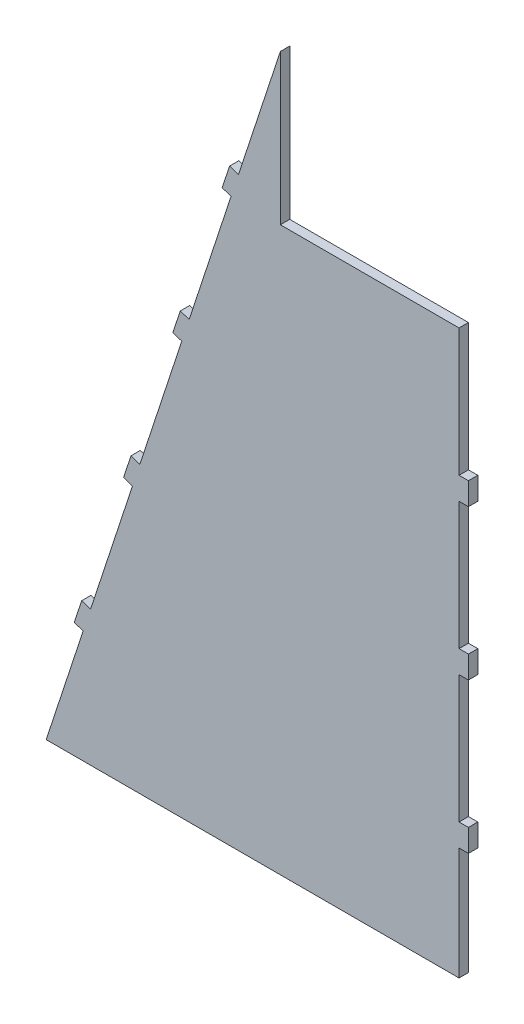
ISO-10303-21;
HEADER;
FILE_DESCRIPTION(('STEP AP214'),'2;1');
FILE_NAME('part.step','',(''),(''),'','','');
FILE_SCHEMA(('AUTOMOTIVE_DESIGN { 1 0 10303 214 1 1 1 1 }'));
ENDSEC;
DATA;
#1=APPLICATION_CONTEXT('core data for automotive mechanical design processes');
#2=APPLICATION_PROTOCOL_DEFINITION('international standard','automotive_design',2000,#1);
#3=PRODUCT_CONTEXT('',#1,'mechanical');
#4=PRODUCT('Part','Part','',(#3));
#5=PRODUCT_RELATED_PRODUCT_CATEGORY('part','',(#4));
#6=PRODUCT_DEFINITION_FORMATION('','',#4);
#7=PRODUCT_DEFINITION_CONTEXT('part definition',#1,'design');
#8=PRODUCT_DEFINITION('design','',#6,#7);
#9=PRODUCT_DEFINITION_SHAPE('','',#8);
#10=(LENGTH_UNIT() NAMED_UNIT(*) SI_UNIT(.MILLI.,.METRE.));
#11=(NAMED_UNIT(*) PLANE_ANGLE_UNIT() SI_UNIT($,.RADIAN.));
#12=(NAMED_UNIT(*) SI_UNIT($,.STERADIAN.) SOLID_ANGLE_UNIT());
#13=UNCERTAINTY_MEASURE_WITH_UNIT(LENGTH_MEASURE(1.E-05),#10,'distance_accuracy_value','');
#14=(GEOMETRIC_REPRESENTATION_CONTEXT(3) GLOBAL_UNCERTAINTY_ASSIGNED_CONTEXT((#13)) GLOBAL_UNIT_ASSIGNED_CONTEXT((#10,
#11,#12)) REPRESENTATION_CONTEXT('',''));
#15=CARTESIAN_POINT('',(0.,0.,0.));
#16=DIRECTION('',(0.,0.,1.));
#17=DIRECTION('',(1.,0.,0.));
#18=AXIS2_PLACEMENT_3D('',#15,#16,#17);
#19=CARTESIAN_POINT('',(26.5042552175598,80.7078217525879,2.5));
#20=DIRECTION('',(-0.312004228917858,-0.950080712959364,0.));
#21=DIRECTION('',(0.950080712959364,-0.312004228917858,0.));
#22=AXIS2_PLACEMENT_3D('',#19,#20,#21);
#23=PLANE('',#22);
#24=DIRECTION('',(-0.950080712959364,0.312004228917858,0.));
#25=VECTOR('',#24,1.);
#26=CARTESIAN_POINT('',(26.5042552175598,80.7078217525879,0.));
#27=LINE('',#26,#25);
#28=CARTESIAN_POINT('',(-26.4218896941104,98.0886408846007,0.));
#29=VERTEX_POINT('',#28);
#30=CARTESIAN_POINT('',(-28.7970914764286,98.868651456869,0.));
#31=VERTEX_POINT('',#30);
#32=EDGE_CURVE('E283',#29,#31,#27,.T.);
#33=ORIENTED_EDGE('',*,*,#32,.F.);
#34=DIRECTION('',(0.,0.,-1.));
#35=VECTOR('',#34,1.);
#36=CARTESIAN_POINT('',(-26.4218896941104,98.0886408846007,2.5));
#37=LINE('',#36,#35);
#38=CARTESIAN_POINT('',(-26.4218896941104,98.0886408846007,2.5));
#39=VERTEX_POINT('',#38);
#40=EDGE_CURVE('E11',#39,#29,#37,.T.);
#41=ORIENTED_EDGE('',*,*,#40,.F.);
#42=DIRECTION('',(-0.950080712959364,0.312004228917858,0.));
#43=VECTOR('',#42,1.);
#44=CARTESIAN_POINT('',(26.5042552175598,80.7078217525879,2.5));
#45=LINE('',#44,#43);
#46=CARTESIAN_POINT('',(-28.7970914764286,98.868651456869,2.5));
#47=VERTEX_POINT('',#46);
#48=EDGE_CURVE('E376',#39,#47,#45,.T.);
#49=ORIENTED_EDGE('',*,*,#48,.T.);
#50=DIRECTION('',(0.,0.,-1.));
#51=VECTOR('',#50,1.);
#52=CARTESIAN_POINT('',(-28.7970914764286,98.868651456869,2.5));
#53=LINE('',#52,#51);
#54=EDGE_CURVE('E55',#47,#31,#53,.T.);
#55=ORIENTED_EDGE('',*,*,#54,.T.);
#56=EDGE_LOOP('',(#33,#41,#49,#55));
#57=FACE_BOUND('',#56,.T.);
#58=ADVANCED_FACE('F39',(#57),#23,.T.);
#59=CARTESIAN_POINT('',(-52.9261449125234,17.3808191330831,2.5));
#60=DIRECTION('',(0.95008071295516,-0.31200422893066,0.));
#61=DIRECTION('',(0.31200422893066,0.95008071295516,0.));
#62=AXIS2_PLACEMENT_3D('',#59,#60,#61);
#63=PLANE('',#62);
#64=DIRECTION('',(-0.31200422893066,-0.95008071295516,0.));
#65=VECTOR('',#64,1.);
#66=CARTESIAN_POINT('',(-52.9261449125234,17.3808191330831,0.));
#67=LINE('',#66,#65);
#68=CARTESIAN_POINT('',(-37.5868821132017,64.0902428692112,0.));
#69=VERTEX_POINT('',#68);
#70=EDGE_CURVE('E285',#29,#69,#67,.T.);
#71=ORIENTED_EDGE('',*,*,#70,.T.);
#72=DIRECTION('',(0.,0.,-1.));
#73=VECTOR('',#72,1.);
#74=CARTESIAN_POINT('',(-37.5868821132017,64.0902428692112,2.5));
#75=LINE('',#74,#73);
#76=CARTESIAN_POINT('',(-37.5868821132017,64.0902428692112,2.5));
#77=VERTEX_POINT('',#76);
#78=EDGE_CURVE('E47',#77,#69,#75,.T.);
#79=ORIENTED_EDGE('',*,*,#78,.F.);
#80=DIRECTION('',(-0.31200422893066,-0.95008071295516,0.));
#81=VECTOR('',#80,1.);
#82=CARTESIAN_POINT('',(-52.9261449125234,17.3808191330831,2.5));
#83=LINE('',#82,#81);
#84=EDGE_CURVE('E456',#39,#77,#83,.T.);
#85=ORIENTED_EDGE('',*,*,#84,.F.);
#86=ORIENTED_EDGE('',*,*,#40,.T.);
#87=EDGE_LOOP('',(#71,#79,#85,#86));
#88=FACE_BOUND('',#87,.T.);
#89=ADVANCED_FACE('F443',(#88),#63,.F.);
#90=CARTESIAN_POINT('',(15.3392627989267,46.7094237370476,2.5));
#91=DIRECTION('',(0.312004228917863,0.950080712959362,0.));
#92=DIRECTION('',(-0.950080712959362,0.312004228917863,0.));
#93=AXIS2_PLACEMENT_3D('',#90,#91,#92);
#94=PLANE('',#93);
#95=DIRECTION('',(0.950080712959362,-0.312004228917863,0.));
#96=VECTOR('',#95,1.);
#97=CARTESIAN_POINT('',(15.3392627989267,46.7094237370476,0.));
#98=LINE('',#97,#96);
#99=CARTESIAN_POINT('',(-39.9620838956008,64.8702534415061,0.));
#100=VERTEX_POINT('',#99);
#101=EDGE_CURVE('E288',#100,#69,#98,.T.);
#102=ORIENTED_EDGE('',*,*,#101,.F.);
#103=DIRECTION('',(0.,0.,-1.));
#104=VECTOR('',#103,1.);
#105=CARTESIAN_POINT('',(-39.9620838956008,64.8702534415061,2.5));
#106=LINE('',#105,#104);
#107=CARTESIAN_POINT('',(-39.9620838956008,64.8702534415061,2.5));
#108=VERTEX_POINT('',#107);
#109=EDGE_CURVE('E433',#108,#100,#106,.T.);
#110=ORIENTED_EDGE('',*,*,#109,.F.);
#111=DIRECTION('',(0.950080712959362,-0.312004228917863,0.));
#112=VECTOR('',#111,1.);
#113=CARTESIAN_POINT('',(15.3392627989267,46.7094237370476,2.5));
#114=LINE('',#113,#112);
#115=EDGE_CURVE('E440',#108,#77,#114,.T.);
#116=ORIENTED_EDGE('',*,*,#115,.T.);
#117=ORIENTED_EDGE('',*,*,#78,.T.);
#118=EDGE_LOOP('',(#102,#110,#116,#117));
#119=FACE_BOUND('',#118,.T.);
#120=ADVANCED_FACE('F438',(#119),#94,.T.);
#121=CARTESIAN_POINT('',(-55.3013466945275,18.1608297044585,2.5));
#122=DIRECTION('',(-0.950080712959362,0.312004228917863,0.));
#123=DIRECTION('',(-0.312004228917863,-0.950080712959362,0.));
#124=AXIS2_PLACEMENT_3D('',#121,#122,#123);
#125=PLANE('',#124);
#126=DIRECTION('',(0.312004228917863,0.950080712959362,0.));
#127=VECTOR('',#126,1.);
#128=CARTESIAN_POINT('',(-55.3013466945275,18.1608297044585,0.));
#129=LINE('',#128,#127);
#130=CARTESIAN_POINT('',(-41.9324695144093,58.8702534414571,0.));
#131=VERTEX_POINT('',#130);
#132=EDGE_CURVE('E291',#131,#100,#129,.T.);
#133=ORIENTED_EDGE('',*,*,#132,.F.);
#134=DIRECTION('',(0.,0.,-1.));
#135=VECTOR('',#134,1.);
#136=CARTESIAN_POINT('',(-41.9324695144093,58.8702534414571,2.5));
#137=LINE('',#136,#135);
#138=CARTESIAN_POINT('',(-41.9324695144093,58.8702534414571,2.5));
#139=VERTEX_POINT('',#138);
#140=EDGE_CURVE('E431',#139,#131,#137,.T.);
#141=ORIENTED_EDGE('',*,*,#140,.F.);
#142=DIRECTION('',(0.312004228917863,0.950080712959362,0.));
#143=VECTOR('',#142,1.);
#144=CARTESIAN_POINT('',(-55.3013466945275,18.1608297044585,2.5));
#145=LINE('',#144,#143);
#146=EDGE_CURVE('E453',#139,#108,#145,.T.);
#147=ORIENTED_EDGE('',*,*,#146,.T.);
#148=ORIENTED_EDGE('',*,*,#109,.T.);
#149=EDGE_LOOP('',(#133,#141,#147,#148));
#150=FACE_BOUND('',#149,.T.);
#151=ADVANCED_FACE('F450',(#150),#125,.T.);
#152=CARTESIAN_POINT('',(13.3688771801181,40.709423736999,2.5));
#153=DIRECTION('',(-0.312004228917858,-0.950080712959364,0.));
#154=DIRECTION('',(0.950080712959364,-0.312004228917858,0.));
#155=AXIS2_PLACEMENT_3D('',#152,#153,#154);
#156=PLANE('',#155);
#157=DIRECTION('',(-0.950080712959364,0.312004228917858,0.));
#158=VECTOR('',#157,1.);
#159=CARTESIAN_POINT('',(13.3688771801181,40.709423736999,0.));
#160=LINE('',#159,#158);
#161=CARTESIAN_POINT('',(-39.5572677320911,58.0902428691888,0.));
#162=VERTEX_POINT('',#161);
#163=EDGE_CURVE('E294',#162,#131,#160,.T.);
#164=ORIENTED_EDGE('',*,*,#163,.F.);
#165=DIRECTION('',(0.,0.,-1.));
#166=VECTOR('',#165,1.);
#167=CARTESIAN_POINT('',(-39.5572677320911,58.0902428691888,2.5));
#168=LINE('',#167,#166);
#169=CARTESIAN_POINT('',(-39.5572677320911,58.0902428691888,2.5));
#170=VERTEX_POINT('',#169);
#171=EDGE_CURVE('E429',#170,#162,#168,.T.);
#172=ORIENTED_EDGE('',*,*,#171,.F.);
#173=DIRECTION('',(-0.950080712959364,0.312004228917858,0.));
#174=VECTOR('',#173,1.);
#175=CARTESIAN_POINT('',(13.3688771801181,40.709423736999,2.5));
#176=LINE('',#175,#174);
#177=EDGE_CURVE('E458',#170,#139,#176,.T.);
#178=ORIENTED_EDGE('',*,*,#177,.T.);
#179=ORIENTED_EDGE('',*,*,#140,.T.);
#180=EDGE_LOOP('',(#164,#172,#178,#179));
#181=FACE_BOUND('',#180,.T.);
#182=ADVANCED_FACE('F559',(#181),#156,.T.);
#183=CARTESIAN_POINT('',(-52.9261449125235,17.3808191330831,2.5));
#184=DIRECTION('',(0.95008071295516,-0.31200422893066,0.));
#185=DIRECTION('',(0.31200422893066,0.95008071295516,0.));
#186=AXIS2_PLACEMENT_3D('',#183,#184,#185);
#187=PLANE('',#186);
#188=DIRECTION('',(-0.31200422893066,-0.95008071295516,0.));
#189=VECTOR('',#188,1.);
#190=CARTESIAN_POINT('',(-52.9261449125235,17.3808191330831,0.));
#191=LINE('',#190,#189);
#192=CARTESIAN_POINT('',(-50.7227862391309,24.0902428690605,0.));
#193=VERTEX_POINT('',#192);
#194=EDGE_CURVE('E297',#162,#193,#191,.T.);
#195=ORIENTED_EDGE('',*,*,#194,.T.);
#196=DIRECTION('',(0.,0.,-1.));
#197=VECTOR('',#196,1.);
#198=CARTESIAN_POINT('',(-50.7227862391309,24.0902428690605,2.5));
#199=LINE('',#198,#197);
#200=CARTESIAN_POINT('',(-50.7227862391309,24.0902428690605,2.5));
#201=VERTEX_POINT('',#200);
#202=EDGE_CURVE('E427',#201,#193,#199,.T.);
#203=ORIENTED_EDGE('',*,*,#202,.F.);
#204=DIRECTION('',(-0.31200422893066,-0.95008071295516,0.));
#205=VECTOR('',#204,1.);
#206=CARTESIAN_POINT('',(-52.9261449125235,17.3808191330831,2.5));
#207=LINE('',#206,#205);
#208=EDGE_CURVE('E464',#170,#201,#207,.T.);
#209=ORIENTED_EDGE('',*,*,#208,.F.);
#210=ORIENTED_EDGE('',*,*,#171,.T.);
#211=EDGE_LOOP('',(#195,#203,#209,#210));
#212=FACE_BOUND('',#211,.T.);
#213=ADVANCED_FACE('F562',(#212),#187,.F.);
#214=CARTESIAN_POINT('',(2.20335867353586,6.70942373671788,2.5));
#215=DIRECTION('',(0.3120042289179,0.95008071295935,0.));
#216=DIRECTION('',(-0.95008071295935,0.3120042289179,0.));
#217=AXIS2_PLACEMENT_3D('',#214,#215,#216);
#218=PLANE('',#217);
#219=DIRECTION('',(0.95008071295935,-0.3120042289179,0.));
#220=VECTOR('',#219,1.);
#221=CARTESIAN_POINT('',(2.20335867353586,6.70942373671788,0.));
#222=LINE('',#221,#220);
#223=CARTESIAN_POINT('',(-53.0979880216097,24.8702534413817,0.));
#224=VERTEX_POINT('',#223);
#225=EDGE_CURVE('E300',#224,#193,#222,.T.);
#226=ORIENTED_EDGE('',*,*,#225,.F.);
#227=DIRECTION('',(0.,0.,-1.));
#228=VECTOR('',#227,1.);
#229=CARTESIAN_POINT('',(-53.0979880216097,24.8702534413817,2.5));
#230=LINE('',#229,#228);
#231=CARTESIAN_POINT('',(-53.0979880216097,24.8702534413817,2.5));
#232=VERTEX_POINT('',#231);
#233=EDGE_CURVE('E425',#232,#224,#230,.T.);
#234=ORIENTED_EDGE('',*,*,#233,.F.);
#235=DIRECTION('',(0.95008071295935,-0.3120042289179,0.));
#236=VECTOR('',#235,1.);
#237=CARTESIAN_POINT('',(2.20335867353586,6.70942373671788,2.5));
#238=LINE('',#237,#236);
#239=EDGE_CURVE('E466',#232,#201,#238,.T.);
#240=ORIENTED_EDGE('',*,*,#239,.T.);
#241=ORIENTED_EDGE('',*,*,#202,.T.);
#242=EDGE_LOOP('',(#226,#234,#240,#241));
#243=FACE_BOUND('',#242,.T.);
#244=ADVANCED_FACE('F566',(#243),#218,.T.);
#245=CARTESIAN_POINT('',(-55.3013466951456,18.1608297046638,2.5));
#246=DIRECTION('',(-0.95008071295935,0.312004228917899,0.));
#247=DIRECTION('',(-0.312004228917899,-0.95008071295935,0.));
#248=AXIS2_PLACEMENT_3D('',#245,#246,#247);
#249=PLANE('',#248);
#250=DIRECTION('',(0.312004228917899,0.95008071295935,0.));
#251=VECTOR('',#250,1.);
#252=CARTESIAN_POINT('',(-55.3013466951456,18.1608297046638,0.));
#253=LINE('',#252,#251);
#254=CARTESIAN_POINT('',(-55.0683736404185,18.8702534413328,0.));
#255=VERTEX_POINT('',#254);
#256=EDGE_CURVE('E303',#255,#224,#253,.T.);
#257=ORIENTED_EDGE('',*,*,#256,.F.);
#258=DIRECTION('',(0.,0.,-1.));
#259=VECTOR('',#258,1.);
#260=CARTESIAN_POINT('',(-55.0683736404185,18.8702534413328,2.5));
#261=LINE('',#260,#259);
#262=CARTESIAN_POINT('',(-55.0683736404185,18.8702534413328,2.5));
#263=VERTEX_POINT('',#262);
#264=EDGE_CURVE('E423',#263,#255,#261,.T.);
#265=ORIENTED_EDGE('',*,*,#264,.F.);
#266=DIRECTION('',(0.312004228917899,0.95008071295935,0.));
#267=VECTOR('',#266,1.);
#268=CARTESIAN_POINT('',(-55.3013466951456,18.1608297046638,2.5));
#269=LINE('',#268,#267);
#270=EDGE_CURVE('E469',#263,#232,#269,.T.);
#271=ORIENTED_EDGE('',*,*,#270,.T.);
#272=ORIENTED_EDGE('',*,*,#233,.T.);
#273=EDGE_LOOP('',(#257,#265,#271,#272));
#274=FACE_BOUND('',#273,.T.);
#275=ADVANCED_FACE('F570',(#274),#249,.T.);
#276=CARTESIAN_POINT('',(0.232973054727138,0.709423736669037,2.5));
#277=DIRECTION('',(-0.312004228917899,-0.95008071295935,0.));
#278=DIRECTION('',(0.95008071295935,-0.312004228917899,0.));
#279=AXIS2_PLACEMENT_3D('',#276,#277,#278);
#280=PLANE('',#279);
#281=DIRECTION('',(-0.95008071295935,0.312004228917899,0.));
#282=VECTOR('',#281,1.);
#283=CARTESIAN_POINT('',(0.232973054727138,0.709423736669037,0.));
#284=LINE('',#283,#282);
#285=CARTESIAN_POINT('',(-52.6931718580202,18.0902428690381,0.));
#286=VERTEX_POINT('',#285);
#287=EDGE_CURVE('E306',#286,#255,#284,.T.);
#288=ORIENTED_EDGE('',*,*,#287,.F.);
#289=DIRECTION('',(0.,0.,-1.));
#290=VECTOR('',#289,1.);
#291=CARTESIAN_POINT('',(-52.6931718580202,18.0902428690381,2.5));
#292=LINE('',#291,#290);
#293=CARTESIAN_POINT('',(-52.6931718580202,18.0902428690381,2.5));
#294=VERTEX_POINT('',#293);
#295=EDGE_CURVE('E421',#294,#286,#292,.T.);
#296=ORIENTED_EDGE('',*,*,#295,.F.);
#297=DIRECTION('',(-0.95008071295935,0.312004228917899,0.));
#298=VECTOR('',#297,1.);
#299=CARTESIAN_POINT('',(0.232973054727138,0.709423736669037,2.5));
#300=LINE('',#299,#298);
#301=EDGE_CURVE('E472',#294,#263,#300,.T.);
#302=ORIENTED_EDGE('',*,*,#301,.T.);
#303=ORIENTED_EDGE('',*,*,#264,.T.);
#304=EDGE_LOOP('',(#288,#296,#302,#303));
#305=FACE_BOUND('',#304,.T.);
#306=ADVANCED_FACE('F574',(#305),#280,.T.);
#307=CARTESIAN_POINT('',(-52.9261449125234,17.3808191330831,2.5));
#308=DIRECTION('',(0.95008071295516,-0.31200422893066,0.));
#309=DIRECTION('',(0.31200422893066,0.95008071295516,0.));
#310=AXIS2_PLACEMENT_3D('',#307,#308,#309);
#311=PLANE('',#310);
#312=DIRECTION('',(-0.31200422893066,-0.95008071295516,0.));
#313=VECTOR('',#312,1.);
#314=CARTESIAN_POINT('',(-52.9261449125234,17.3808191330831,0.));
#315=LINE('',#314,#313);
#316=CARTESIAN_POINT('',(-63.8586903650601,-15.9097571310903,0.));
#317=VERTEX_POINT('',#316);
#318=EDGE_CURVE('E309',#286,#317,#315,.T.);
#319=ORIENTED_EDGE('',*,*,#318,.T.);
#320=DIRECTION('',(0.,0.,-1.));
#321=VECTOR('',#320,1.);
#322=CARTESIAN_POINT('',(-63.8586903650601,-15.9097571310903,2.5));
#323=LINE('',#322,#321);
#324=CARTESIAN_POINT('',(-63.8586903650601,-15.9097571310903,2.5));
#325=VERTEX_POINT('',#324);
#326=EDGE_CURVE('E419',#325,#317,#323,.T.);
#327=ORIENTED_EDGE('',*,*,#326,.F.);
#328=DIRECTION('',(-0.31200422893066,-0.95008071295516,0.));
#329=VECTOR('',#328,1.);
#330=CARTESIAN_POINT('',(-52.9261449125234,17.3808191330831,2.5));
#331=LINE('',#330,#329);
#332=EDGE_CURVE('E475',#294,#325,#331,.T.);
#333=ORIENTED_EDGE('',*,*,#332,.F.);
#334=ORIENTED_EDGE('',*,*,#295,.T.);
#335=EDGE_LOOP('',(#319,#327,#333,#334));
#336=FACE_BOUND('',#335,.T.);
#337=ADVANCED_FACE('F578',(#336),#311,.F.);
#338=CARTESIAN_POINT('',(-10.9325454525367,-33.2905762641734,2.5));
#339=DIRECTION('',(0.312004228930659,0.95008071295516,0.));
#340=DIRECTION('',(-0.95008071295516,0.312004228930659,0.));
#341=AXIS2_PLACEMENT_3D('',#338,#339,#340);
#342=PLANE('',#341);
#343=DIRECTION('',(0.95008071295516,-0.312004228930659,0.));
#344=VECTOR('',#343,1.);
#345=CARTESIAN_POINT('',(-10.9325454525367,-33.2905762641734,0.));
#346=LINE('',#345,#344);
#347=CARTESIAN_POINT('',(-66.2338921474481,-15.1297465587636,0.));
#348=VERTEX_POINT('',#347);
#349=EDGE_CURVE('E312',#348,#317,#346,.T.);
#350=ORIENTED_EDGE('',*,*,#349,.F.);
#351=DIRECTION('',(0.,0.,-1.));
#352=VECTOR('',#351,1.);
#353=CARTESIAN_POINT('',(-66.2338921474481,-15.1297465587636,2.5));
#354=LINE('',#353,#352);
#355=CARTESIAN_POINT('',(-66.2338921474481,-15.1297465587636,2.5));
#356=VERTEX_POINT('',#355);
#357=EDGE_CURVE('E417',#356,#348,#354,.T.);
#358=ORIENTED_EDGE('',*,*,#357,.F.);
#359=DIRECTION('',(0.95008071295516,-0.312004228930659,0.));
#360=VECTOR('',#359,1.);
#361=CARTESIAN_POINT('',(-10.9325454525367,-33.2905762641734,2.5));
#362=LINE('',#361,#360);
#363=EDGE_CURVE('E477',#356,#325,#362,.T.);
#364=ORIENTED_EDGE('',*,*,#363,.T.);
#365=ORIENTED_EDGE('',*,*,#326,.T.);
#366=EDGE_LOOP('',(#350,#358,#364,#365));
#367=FACE_BOUND('',#366,.T.);
#368=ADVANCED_FACE('F582',(#367),#342,.T.);
#369=CARTESIAN_POINT('',(-55.3013466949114,18.1608297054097,2.5));
#370=DIRECTION('',(-0.95008071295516,0.312004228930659,0.));
#371=DIRECTION('',(-0.312004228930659,-0.95008071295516,0.));
#372=AXIS2_PLACEMENT_3D('',#369,#370,#371);
#373=PLANE('',#372);
#374=DIRECTION('',(0.312004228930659,0.95008071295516,0.));
#375=VECTOR('',#374,1.);
#376=CARTESIAN_POINT('',(-55.3013466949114,18.1608297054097,0.));
#377=LINE('',#376,#375);
#378=CARTESIAN_POINT('',(-68.2042777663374,-21.1297465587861,0.));
#379=VERTEX_POINT('',#378);
#380=EDGE_CURVE('E315',#379,#348,#377,.T.);
#381=ORIENTED_EDGE('',*,*,#380,.F.);
#382=DIRECTION('',(0.,0.,-1.));
#383=VECTOR('',#382,1.);
#384=CARTESIAN_POINT('',(-68.2042777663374,-21.1297465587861,2.5));
#385=LINE('',#384,#383);
#386=CARTESIAN_POINT('',(-68.2042777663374,-21.1297465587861,2.5));
#387=VERTEX_POINT('',#386);
#388=EDGE_CURVE('E415',#387,#379,#385,.T.);
#389=ORIENTED_EDGE('',*,*,#388,.F.);
#390=DIRECTION('',(0.312004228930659,0.95008071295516,0.));
#391=VECTOR('',#390,1.);
#392=CARTESIAN_POINT('',(-55.3013466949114,18.1608297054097,2.5));
#393=LINE('',#392,#391);
#394=EDGE_CURVE('E480',#387,#356,#393,.T.);
#395=ORIENTED_EDGE('',*,*,#394,.T.);
#396=ORIENTED_EDGE('',*,*,#357,.T.);
#397=EDGE_LOOP('',(#381,#389,#395,#396));
#398=FACE_BOUND('',#397,.T.);
#399=ADVANCED_FACE('F586',(#398),#373,.T.);
#400=CARTESIAN_POINT('',(-12.9029310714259,-39.2905762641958,2.5));
#401=DIRECTION('',(-0.312004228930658,-0.95008071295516,0.));
#402=DIRECTION('',(0.95008071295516,-0.312004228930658,0.));
#403=AXIS2_PLACEMENT_3D('',#400,#401,#402);
#404=PLANE('',#403);
#405=DIRECTION('',(-0.95008071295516,0.312004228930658,0.));
#406=VECTOR('',#405,1.);
#407=CARTESIAN_POINT('',(-12.9029310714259,-39.2905762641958,0.));
#408=LINE('',#407,#406);
#409=CARTESIAN_POINT('',(-65.8290759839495,-21.9097571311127,0.));
#410=VERTEX_POINT('',#409);
#411=EDGE_CURVE('E318',#410,#379,#408,.T.);
#412=ORIENTED_EDGE('',*,*,#411,.F.);
#413=DIRECTION('',(0.,0.,-1.));
#414=VECTOR('',#413,1.);
#415=CARTESIAN_POINT('',(-65.8290759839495,-21.9097571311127,2.5));
#416=LINE('',#415,#414);
#417=CARTESIAN_POINT('',(-65.8290759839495,-21.9097571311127,2.5));
#418=VERTEX_POINT('',#417);
#419=EDGE_CURVE('E413',#418,#410,#416,.T.);
#420=ORIENTED_EDGE('',*,*,#419,.F.);
#421=DIRECTION('',(-0.95008071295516,0.312004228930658,0.));
#422=VECTOR('',#421,1.);
#423=CARTESIAN_POINT('',(-12.9029310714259,-39.2905762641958,2.5));
#424=LINE('',#423,#422);
#425=EDGE_CURVE('E483',#418,#387,#424,.T.);
#426=ORIENTED_EDGE('',*,*,#425,.T.);
#427=ORIENTED_EDGE('',*,*,#388,.T.);
#428=EDGE_LOOP('',(#412,#420,#426,#427));
#429=FACE_BOUND('',#428,.T.);
#430=ADVANCED_FACE('F590',(#429),#404,.T.);
#431=CARTESIAN_POINT('',(-52.9261449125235,17.3808191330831,2.5));
#432=DIRECTION('',(0.95008071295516,-0.31200422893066,0.));
#433=DIRECTION('',(0.31200422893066,0.95008071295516,0.));
#434=AXIS2_PLACEMENT_3D('',#431,#432,#433);
#435=PLANE('',#434);
#436=DIRECTION('',(-0.31200422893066,-0.95008071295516,0.));
#437=VECTOR('',#436,1.);
#438=CARTESIAN_POINT('',(-52.9261449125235,17.3808191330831,0.));
#439=LINE('',#438,#437);
#440=CARTESIAN_POINT('',(-75.6810040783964,-51.9097571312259,0.));
#441=VERTEX_POINT('',#440);
#442=EDGE_CURVE('E321',#410,#441,#439,.T.);
#443=ORIENTED_EDGE('',*,*,#442,.T.);
#444=DIRECTION('',(0.,0.,-1.));
#445=VECTOR('',#444,1.);
#446=CARTESIAN_POINT('',(-75.6810040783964,-51.9097571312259,2.5));
#447=LINE('',#446,#445);
#448=CARTESIAN_POINT('',(-75.6810040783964,-51.9097571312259,2.5));
#449=VERTEX_POINT('',#448);
#450=EDGE_CURVE('E411',#449,#441,#447,.T.);
#451=ORIENTED_EDGE('',*,*,#450,.F.);
#452=DIRECTION('',(-0.31200422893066,-0.95008071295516,0.));
#453=VECTOR('',#452,1.);
#454=CARTESIAN_POINT('',(-52.9261449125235,17.3808191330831,2.5));
#455=LINE('',#454,#453);
#456=EDGE_CURVE('E486',#418,#449,#455,.T.);
#457=ORIENTED_EDGE('',*,*,#456,.F.);
#458=ORIENTED_EDGE('',*,*,#419,.T.);
#459=EDGE_LOOP('',(#443,#451,#457,#458));
#460=FACE_BOUND('',#459,.T.);
#461=ADVANCED_FACE('F594',(#460),#435,.F.);
#462=CARTESIAN_POINT('',(0.,-51.9097571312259,2.5));
#463=DIRECTION('',(0.,-1.,0.));
#464=DIRECTION('',(1.,0.,0.));
#465=AXIS2_PLACEMENT_3D('',#462,#463,#464);
#466=PLANE('',#465);
#467=DIRECTION('',(-1.,0.,0.));
#468=VECTOR('',#467,1.);
#469=CARTESIAN_POINT('',(0.,-51.9097571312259,0.));
#470=LINE('',#469,#468);
#471=CARTESIAN_POINT('',(34.3189959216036,-51.9097571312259,0.));
#472=VERTEX_POINT('',#471);
#473=EDGE_CURVE('E324',#472,#441,#470,.T.);
#474=ORIENTED_EDGE('',*,*,#473,.F.);
#475=DIRECTION('',(0.,0.,-1.));
#476=VECTOR('',#475,1.);
#477=CARTESIAN_POINT('',(34.3189959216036,-51.9097571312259,2.5));
#478=LINE('',#477,#476);
#479=CARTESIAN_POINT('',(34.3189959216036,-51.9097571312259,2.5));
#480=VERTEX_POINT('',#479);
#481=EDGE_CURVE('E409',#480,#472,#478,.T.);
#482=ORIENTED_EDGE('',*,*,#481,.F.);
#483=DIRECTION('',(-1.,0.,0.));
#484=VECTOR('',#483,1.);
#485=CARTESIAN_POINT('',(0.,-51.9097571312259,2.5));
#486=LINE('',#485,#484);
#487=EDGE_CURVE('E488',#480,#449,#486,.T.);
#488=ORIENTED_EDGE('',*,*,#487,.T.);
#489=ORIENTED_EDGE('',*,*,#450,.T.);
#490=EDGE_LOOP('',(#474,#482,#488,#489));
#491=FACE_BOUND('',#490,.T.);
#492=ADVANCED_FACE('F598',(#491),#466,.T.);
#493=CARTESIAN_POINT('',(34.3189959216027,5.63588229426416E-13,2.5));
#494=DIRECTION('',(1.,0.,0.));
#495=DIRECTION('',(0.,1.,0.));
#496=AXIS2_PLACEMENT_3D('',#493,#494,#495);
#497=PLANE('',#496);
#498=DIRECTION('',(0.,-1.,0.));
#499=VECTOR('',#498,1.);
#500=CARTESIAN_POINT('',(34.3189959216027,5.63588229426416E-13,0.));
#501=LINE('',#500,#499);
#502=CARTESIAN_POINT('',(34.3189959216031,-21.9097571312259,0.));
#503=VERTEX_POINT('',#502);
#504=EDGE_CURVE('E327',#503,#472,#501,.T.);
#505=ORIENTED_EDGE('',*,*,#504,.F.);
#506=DIRECTION('',(0.,0.,-1.));
#507=VECTOR('',#506,1.);
#508=CARTESIAN_POINT('',(34.3189959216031,-21.9097571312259,2.5));
#509=LINE('',#508,#507);
#510=CARTESIAN_POINT('',(34.3189959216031,-21.9097571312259,2.5));
#511=VERTEX_POINT('',#510);
#512=EDGE_CURVE('E407',#511,#503,#509,.T.);
#513=ORIENTED_EDGE('',*,*,#512,.F.);
#514=DIRECTION('',(0.,-1.,0.));
#515=VECTOR('',#514,1.);
#516=CARTESIAN_POINT('',(34.3189959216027,5.63588229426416E-13,2.5));
#517=LINE('',#516,#515);
#518=EDGE_CURVE('E491',#511,#480,#517,.T.);
#519=ORIENTED_EDGE('',*,*,#518,.T.);
#520=ORIENTED_EDGE('',*,*,#481,.T.);
#521=EDGE_LOOP('',(#505,#513,#519,#520));
#522=FACE_BOUND('',#521,.T.);
#523=ADVANCED_FACE('F602',(#522),#497,.T.);
#524=CARTESIAN_POINT('',(0.,-21.9097571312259,2.5));
#525=DIRECTION('',(0.,1.,0.));
#526=DIRECTION('',(0.,0.,1.));
#527=AXIS2_PLACEMENT_3D('',#524,#525,#526);
#528=PLANE('',#527);
#529=DIRECTION('',(1.,0.,0.));
#530=VECTOR('',#529,1.);
#531=CARTESIAN_POINT('',(0.,-21.9097571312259,0.));
#532=LINE('',#531,#530);
#533=CARTESIAN_POINT('',(36.8189959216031,-21.9097571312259,0.));
#534=VERTEX_POINT('',#533);
#535=EDGE_CURVE('E330',#503,#534,#532,.T.);
#536=ORIENTED_EDGE('',*,*,#535,.T.);
#537=DIRECTION('',(0.,0.,-1.));
#538=VECTOR('',#537,1.);
#539=CARTESIAN_POINT('',(36.8189959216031,-21.9097571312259,2.5));
#540=LINE('',#539,#538);
#541=CARTESIAN_POINT('',(36.8189959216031,-21.9097571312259,2.5));
#542=VERTEX_POINT('',#541);
#543=EDGE_CURVE('E405',#542,#534,#540,.T.);
#544=ORIENTED_EDGE('',*,*,#543,.F.);
#545=DIRECTION('',(1.,0.,0.));
#546=VECTOR('',#545,1.);
#547=CARTESIAN_POINT('',(0.,-21.9097571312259,2.5));
#548=LINE('',#547,#546);
#549=EDGE_CURVE('E494',#511,#542,#548,.T.);
#550=ORIENTED_EDGE('',*,*,#549,.F.);
#551=ORIENTED_EDGE('',*,*,#512,.T.);
#552=EDGE_LOOP('',(#536,#544,#550,#551));
#553=FACE_BOUND('',#552,.T.);
#554=ADVANCED_FACE('F606',(#553),#528,.F.);
#555=CARTESIAN_POINT('',(36.8189959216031,0.,2.5));
#556=DIRECTION('',(1.,0.,0.));
#557=DIRECTION('',(0.,0.,-1.));
#558=AXIS2_PLACEMENT_3D('',#555,#556,#557);
#559=PLANE('',#558);
#560=DIRECTION('',(0.,-1.,0.));
#561=VECTOR('',#560,1.);
#562=CARTESIAN_POINT('',(36.8189959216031,0.,0.));
#563=LINE('',#562,#561);
#564=CARTESIAN_POINT('',(36.8189959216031,-15.9097571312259,0.));
#565=VERTEX_POINT('',#564);
#566=EDGE_CURVE('E333',#565,#534,#563,.T.);
#567=ORIENTED_EDGE('',*,*,#566,.F.);
#568=DIRECTION('',(0.,0.,-1.));
#569=VECTOR('',#568,1.);
#570=CARTESIAN_POINT('',(36.8189959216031,-15.9097571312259,2.5));
#571=LINE('',#570,#569);
#572=CARTESIAN_POINT('',(36.8189959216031,-15.9097571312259,2.5));
#573=VERTEX_POINT('',#572);
#574=EDGE_CURVE('E403',#573,#565,#571,.T.);
#575=ORIENTED_EDGE('',*,*,#574,.F.);
#576=DIRECTION('',(0.,-1.,0.));
#577=VECTOR('',#576,1.);
#578=CARTESIAN_POINT('',(36.8189959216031,0.,2.5));
#579=LINE('',#578,#577);
#580=EDGE_CURVE('E496',#573,#542,#579,.T.);
#581=ORIENTED_EDGE('',*,*,#580,.T.);
#582=ORIENTED_EDGE('',*,*,#543,.T.);
#583=EDGE_LOOP('',(#567,#575,#581,#582));
#584=FACE_BOUND('',#583,.T.);
#585=ADVANCED_FACE('F610',(#584),#559,.T.);
#586=CARTESIAN_POINT('',(1.05980272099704E-12,-15.9097571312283,2.5));
#587=DIRECTION('',(0.,1.,0.));
#588=DIRECTION('',(-1.,0.,0.));
#589=AXIS2_PLACEMENT_3D('',#586,#587,#588);
#590=PLANE('',#589);
#591=DIRECTION('',(1.,0.,0.));
#592=VECTOR('',#591,1.);
#593=CARTESIAN_POINT('',(1.05980272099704E-12,-15.9097571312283,0.));
#594=LINE('',#593,#592);
#595=CARTESIAN_POINT('',(34.3189959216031,-15.909757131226,0.));
#596=VERTEX_POINT('',#595);
#597=EDGE_CURVE('E336',#596,#565,#594,.T.);
#598=ORIENTED_EDGE('',*,*,#597,.F.);
#599=DIRECTION('',(0.,0.,-1.));
#600=VECTOR('',#599,1.);
#601=CARTESIAN_POINT('',(34.3189959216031,-15.909757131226,2.5));
#602=LINE('',#601,#600);
#603=CARTESIAN_POINT('',(34.3189959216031,-15.909757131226,2.5));
#604=VERTEX_POINT('',#603);
#605=EDGE_CURVE('E401',#604,#596,#602,.T.);
#606=ORIENTED_EDGE('',*,*,#605,.F.);
#607=DIRECTION('',(1.,0.,0.));
#608=VECTOR('',#607,1.);
#609=CARTESIAN_POINT('',(1.05980272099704E-12,-15.9097571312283,2.5));
#610=LINE('',#609,#608);
#611=EDGE_CURVE('E499',#604,#573,#610,.T.);
#612=ORIENTED_EDGE('',*,*,#611,.T.);
#613=ORIENTED_EDGE('',*,*,#574,.T.);
#614=EDGE_LOOP('',(#598,#606,#612,#613));
#615=FACE_BOUND('',#614,.T.);
#616=ADVANCED_FACE('F614',(#615),#590,.T.);
#617=CARTESIAN_POINT('',(34.318995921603,1.33075928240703E-13,2.5));
#618=DIRECTION('',(1.,0.,0.));
#619=DIRECTION('',(0.,1.,0.));
#620=AXIS2_PLACEMENT_3D('',#617,#618,#619);
#621=PLANE('',#620);
#622=DIRECTION('',(0.,-1.,0.));
#623=VECTOR('',#622,1.);
#624=CARTESIAN_POINT('',(34.318995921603,1.33075928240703E-13,0.));
#625=LINE('',#624,#623);
#626=CARTESIAN_POINT('',(34.318995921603,18.0902428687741,0.));
#627=VERTEX_POINT('',#626);
#628=EDGE_CURVE('E339',#627,#596,#625,.T.);
#629=ORIENTED_EDGE('',*,*,#628,.F.);
#630=DIRECTION('',(0.,0.,-1.));
#631=VECTOR('',#630,1.);
#632=CARTESIAN_POINT('',(34.318995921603,18.0902428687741,2.5));
#633=LINE('',#632,#631);
#634=CARTESIAN_POINT('',(34.318995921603,18.0902428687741,2.5));
#635=VERTEX_POINT('',#634);
#636=EDGE_CURVE('E399',#635,#627,#633,.T.);
#637=ORIENTED_EDGE('',*,*,#636,.F.);
#638=DIRECTION('',(0.,-1.,0.));
#639=VECTOR('',#638,1.);
#640=CARTESIAN_POINT('',(34.318995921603,1.33075928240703E-13,2.5));
#641=LINE('',#640,#639);
#642=EDGE_CURVE('E502',#635,#604,#641,.T.);
#643=ORIENTED_EDGE('',*,*,#642,.T.);
#644=ORIENTED_EDGE('',*,*,#605,.T.);
#645=EDGE_LOOP('',(#629,#637,#643,#644));
#646=FACE_BOUND('',#645,.T.);
#647=ADVANCED_FACE('F618',(#646),#621,.T.);
#648=CARTESIAN_POINT('',(0.,18.0902428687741,2.5));
#649=DIRECTION('',(0.,1.,0.));
#650=DIRECTION('',(0.,0.,1.));
#651=AXIS2_PLACEMENT_3D('',#648,#649,#650);
#652=PLANE('',#651);
#653=DIRECTION('',(1.,0.,0.));
#654=VECTOR('',#653,1.);
#655=CARTESIAN_POINT('',(0.,18.0902428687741,0.));
#656=LINE('',#655,#654);
#657=CARTESIAN_POINT('',(36.8189959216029,18.0902428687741,0.));
#658=VERTEX_POINT('',#657);
#659=EDGE_CURVE('E342',#627,#658,#656,.T.);
#660=ORIENTED_EDGE('',*,*,#659,.T.);
#661=DIRECTION('',(0.,0.,-1.));
#662=VECTOR('',#661,1.);
#663=CARTESIAN_POINT('',(36.8189959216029,18.0902428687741,2.5));
#664=LINE('',#663,#662);
#665=CARTESIAN_POINT('',(36.8189959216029,18.0902428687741,2.5));
#666=VERTEX_POINT('',#665);
#667=EDGE_CURVE('E397',#666,#658,#664,.T.);
#668=ORIENTED_EDGE('',*,*,#667,.F.);
#669=DIRECTION('',(1.,0.,0.));
#670=VECTOR('',#669,1.);
#671=CARTESIAN_POINT('',(0.,18.0902428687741,2.5));
#672=LINE('',#671,#670);
#673=EDGE_CURVE('E505',#635,#666,#672,.T.);
#674=ORIENTED_EDGE('',*,*,#673,.F.);
#675=ORIENTED_EDGE('',*,*,#636,.T.);
#676=EDGE_LOOP('',(#660,#668,#674,#675));
#677=FACE_BOUND('',#676,.T.);
#678=ADVANCED_FACE('F622',(#677),#652,.F.);
#679=CARTESIAN_POINT('',(36.8189959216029,0.,2.5));
#680=DIRECTION('',(1.,0.,0.));
#681=DIRECTION('',(0.,0.,-1.));
#682=AXIS2_PLACEMENT_3D('',#679,#680,#681);
#683=PLANE('',#682);
#684=DIRECTION('',(0.,-1.,0.));
#685=VECTOR('',#684,1.);
#686=CARTESIAN_POINT('',(36.8189959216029,0.,0.));
#687=LINE('',#686,#685);
#688=CARTESIAN_POINT('',(36.8189959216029,24.0902428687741,0.));
#689=VERTEX_POINT('',#688);
#690=EDGE_CURVE('E345',#689,#658,#687,.T.);
#691=ORIENTED_EDGE('',*,*,#690,.F.);
#692=DIRECTION('',(0.,0.,-1.));
#693=VECTOR('',#692,1.);
#694=CARTESIAN_POINT('',(36.8189959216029,24.0902428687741,2.5));
#695=LINE('',#694,#693);
#696=CARTESIAN_POINT('',(36.8189959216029,24.0902428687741,2.5));
#697=VERTEX_POINT('',#696);
#698=EDGE_CURVE('E395',#697,#689,#695,.T.);
#699=ORIENTED_EDGE('',*,*,#698,.F.);
#700=DIRECTION('',(0.,-1.,0.));
#701=VECTOR('',#700,1.);
#702=CARTESIAN_POINT('',(36.8189959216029,0.,2.5));
#703=LINE('',#702,#701);
#704=EDGE_CURVE('E507',#697,#666,#703,.T.);
#705=ORIENTED_EDGE('',*,*,#704,.T.);
#706=ORIENTED_EDGE('',*,*,#667,.T.);
#707=EDGE_LOOP('',(#691,#699,#705,#706));
#708=FACE_BOUND('',#707,.T.);
#709=ADVANCED_FACE('F626',(#708),#683,.T.);
#710=CARTESIAN_POINT('',(-1.60473253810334E-12,24.0902428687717,2.5));
#711=DIRECTION('',(0.,1.,0.));
#712=DIRECTION('',(-1.,0.,0.));
#713=AXIS2_PLACEMENT_3D('',#710,#711,#712);
#714=PLANE('',#713);
#715=DIRECTION('',(1.,0.,0.));
#716=VECTOR('',#715,1.);
#717=CARTESIAN_POINT('',(-1.60473253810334E-12,24.0902428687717,0.));
#718=LINE('',#717,#716);
#719=CARTESIAN_POINT('',(34.3189959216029,24.090242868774,0.));
#720=VERTEX_POINT('',#719);
#721=EDGE_CURVE('E348',#720,#689,#718,.T.);
#722=ORIENTED_EDGE('',*,*,#721,.F.);
#723=DIRECTION('',(0.,0.,-1.));
#724=VECTOR('',#723,1.);
#725=CARTESIAN_POINT('',(34.3189959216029,24.090242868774,2.5));
#726=LINE('',#725,#724);
#727=CARTESIAN_POINT('',(34.3189959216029,24.090242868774,2.5));
#728=VERTEX_POINT('',#727);
#729=EDGE_CURVE('E393',#728,#720,#726,.T.);
#730=ORIENTED_EDGE('',*,*,#729,.F.);
#731=DIRECTION('',(1.,0.,0.));
#732=VECTOR('',#731,1.);
#733=CARTESIAN_POINT('',(-1.60473253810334E-12,24.0902428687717,2.5));
#734=LINE('',#733,#732);
#735=EDGE_CURVE('E510',#728,#697,#734,.T.);
#736=ORIENTED_EDGE('',*,*,#735,.T.);
#737=ORIENTED_EDGE('',*,*,#698,.T.);
#738=EDGE_LOOP('',(#722,#730,#736,#737));
#739=FACE_BOUND('',#738,.T.);
#740=ADVANCED_FACE('F630',(#739),#714,.T.);
#741=CARTESIAN_POINT('',(34.318995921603,1.33075928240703E-13,2.5));
#742=DIRECTION('',(1.,0.,0.));
#743=DIRECTION('',(0.,1.,0.));
#744=AXIS2_PLACEMENT_3D('',#741,#742,#743);
#745=PLANE('',#744);
#746=DIRECTION('',(0.,-1.,0.));
#747=VECTOR('',#746,1.);
#748=CARTESIAN_POINT('',(34.318995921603,1.33075928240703E-13,0.));
#749=LINE('',#748,#747);
#750=CARTESIAN_POINT('',(34.3189959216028,58.0902428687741,0.));
#751=VERTEX_POINT('',#750);
#752=EDGE_CURVE('E351',#751,#720,#749,.T.);
#753=ORIENTED_EDGE('',*,*,#752,.F.);
#754=DIRECTION('',(0.,0.,-1.));
#755=VECTOR('',#754,1.);
#756=CARTESIAN_POINT('',(34.3189959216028,58.0902428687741,2.5));
#757=LINE('',#756,#755);
#758=CARTESIAN_POINT('',(34.3189959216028,58.0902428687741,2.5));
#759=VERTEX_POINT('',#758);
#760=EDGE_CURVE('E391',#759,#751,#757,.T.);
#761=ORIENTED_EDGE('',*,*,#760,.F.);
#762=DIRECTION('',(0.,-1.,0.));
#763=VECTOR('',#762,1.);
#764=CARTESIAN_POINT('',(34.318995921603,1.33075928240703E-13,2.5));
#765=LINE('',#764,#763);
#766=EDGE_CURVE('E513',#759,#728,#765,.T.);
#767=ORIENTED_EDGE('',*,*,#766,.T.);
#768=ORIENTED_EDGE('',*,*,#729,.T.);
#769=EDGE_LOOP('',(#753,#761,#767,#768));
#770=FACE_BOUND('',#769,.T.);
#771=ADVANCED_FACE('F634',(#770),#745,.T.);
#772=CARTESIAN_POINT('',(0.,58.0902428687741,2.5));
#773=DIRECTION('',(0.,1.,0.));
#774=DIRECTION('',(0.,0.,1.));
#775=AXIS2_PLACEMENT_3D('',#772,#773,#774);
#776=PLANE('',#775);
#777=DIRECTION('',(1.,0.,0.));
#778=VECTOR('',#777,1.);
#779=CARTESIAN_POINT('',(0.,58.0902428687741,0.));
#780=LINE('',#779,#778);
#781=CARTESIAN_POINT('',(36.8189959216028,58.0902428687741,0.));
#782=VERTEX_POINT('',#781);
#783=EDGE_CURVE('E354',#751,#782,#780,.T.);
#784=ORIENTED_EDGE('',*,*,#783,.T.);
#785=DIRECTION('',(0.,0.,-1.));
#786=VECTOR('',#785,1.);
#787=CARTESIAN_POINT('',(36.8189959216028,58.0902428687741,2.5));
#788=LINE('',#787,#786);
#789=CARTESIAN_POINT('',(36.8189959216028,58.0902428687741,2.5));
#790=VERTEX_POINT('',#789);
#791=EDGE_CURVE('E389',#790,#782,#788,.T.);
#792=ORIENTED_EDGE('',*,*,#791,.F.);
#793=DIRECTION('',(1.,0.,0.));
#794=VECTOR('',#793,1.);
#795=CARTESIAN_POINT('',(0.,58.0902428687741,2.5));
#796=LINE('',#795,#794);
#797=EDGE_CURVE('E516',#759,#790,#796,.T.);
#798=ORIENTED_EDGE('',*,*,#797,.F.);
#799=ORIENTED_EDGE('',*,*,#760,.T.);
#800=EDGE_LOOP('',(#784,#792,#798,#799));
#801=FACE_BOUND('',#800,.T.);
#802=ADVANCED_FACE('F638',(#801),#776,.F.);
#803=CARTESIAN_POINT('',(36.8189959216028,0.,2.5));
#804=DIRECTION('',(1.,0.,0.));
#805=DIRECTION('',(0.,0.,-1.));
#806=AXIS2_PLACEMENT_3D('',#803,#804,#805);
#807=PLANE('',#806);
#808=DIRECTION('',(0.,-1.,0.));
#809=VECTOR('',#808,1.);
#810=CARTESIAN_POINT('',(36.8189959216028,0.,0.));
#811=LINE('',#810,#809);
#812=CARTESIAN_POINT('',(36.8189959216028,64.0902428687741,0.));
#813=VERTEX_POINT('',#812);
#814=EDGE_CURVE('E357',#813,#782,#811,.T.);
#815=ORIENTED_EDGE('',*,*,#814,.F.);
#816=DIRECTION('',(0.,0.,-1.));
#817=VECTOR('',#816,1.);
#818=CARTESIAN_POINT('',(36.8189959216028,64.0902428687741,2.5));
#819=LINE('',#818,#817);
#820=CARTESIAN_POINT('',(36.8189959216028,64.0902428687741,2.5));
#821=VERTEX_POINT('',#820);
#822=EDGE_CURVE('E387',#821,#813,#819,.T.);
#823=ORIENTED_EDGE('',*,*,#822,.F.);
#824=DIRECTION('',(0.,-1.,0.));
#825=VECTOR('',#824,1.);
#826=CARTESIAN_POINT('',(36.8189959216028,0.,2.5));
#827=LINE('',#826,#825);
#828=EDGE_CURVE('E518',#821,#790,#827,.T.);
#829=ORIENTED_EDGE('',*,*,#828,.T.);
#830=ORIENTED_EDGE('',*,*,#791,.T.);
#831=EDGE_LOOP('',(#815,#823,#829,#830));
#832=FACE_BOUND('',#831,.T.);
#833=ADVANCED_FACE('F642',(#832),#807,.T.);
#834=CARTESIAN_POINT('',(-4.26926779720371E-12,64.0902428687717,2.5));
#835=DIRECTION('',(0.,1.,0.));
#836=DIRECTION('',(-1.,0.,0.));
#837=AXIS2_PLACEMENT_3D('',#834,#835,#836);
#838=PLANE('',#837);
#839=DIRECTION('',(1.,0.,0.));
#840=VECTOR('',#839,1.);
#841=CARTESIAN_POINT('',(-4.26926779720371E-12,64.0902428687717,0.));
#842=LINE('',#841,#840);
#843=CARTESIAN_POINT('',(34.3189959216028,64.090242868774,0.));
#844=VERTEX_POINT('',#843);
#845=EDGE_CURVE('E360',#844,#813,#842,.T.);
#846=ORIENTED_EDGE('',*,*,#845,.F.);
#847=DIRECTION('',(0.,0.,-1.));
#848=VECTOR('',#847,1.);
#849=CARTESIAN_POINT('',(34.3189959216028,64.090242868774,2.5));
#850=LINE('',#849,#848);
#851=CARTESIAN_POINT('',(34.3189959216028,64.090242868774,2.5));
#852=VERTEX_POINT('',#851);
#853=EDGE_CURVE('E385',#852,#844,#850,.T.);
#854=ORIENTED_EDGE('',*,*,#853,.F.);
#855=DIRECTION('',(1.,0.,0.));
#856=VECTOR('',#855,1.);
#857=CARTESIAN_POINT('',(-4.26926779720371E-12,64.0902428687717,2.5));
#858=LINE('',#857,#856);
#859=EDGE_CURVE('E521',#852,#821,#858,.T.);
#860=ORIENTED_EDGE('',*,*,#859,.T.);
#861=ORIENTED_EDGE('',*,*,#822,.T.);
#862=EDGE_LOOP('',(#846,#854,#860,#861));
#863=FACE_BOUND('',#862,.T.);
#864=ADVANCED_FACE('F646',(#863),#838,.T.);
#865=CARTESIAN_POINT('',(34.3189959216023,-2.59147860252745E-13,2.5));
#866=DIRECTION('',(1.,0.,0.));
#867=DIRECTION('',(0.,1.,0.));
#868=AXIS2_PLACEMENT_3D('',#865,#866,#867);
#869=PLANE('',#868);
#870=DIRECTION('',(0.,-1.,0.));
#871=VECTOR('',#870,1.);
#872=CARTESIAN_POINT('',(34.3189959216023,-2.59147860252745E-13,0.));
#873=LINE('',#872,#871);
#874=CARTESIAN_POINT('',(34.3189959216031,98.0902428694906,0.));
#875=VERTEX_POINT('',#874);
#876=EDGE_CURVE('E363',#875,#844,#873,.T.);
#877=ORIENTED_EDGE('',*,*,#876,.F.);
#878=DIRECTION('',(0.,0.,-1.));
#879=VECTOR('',#878,1.);
#880=CARTESIAN_POINT('',(34.3189959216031,98.0902428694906,2.5));
#881=LINE('',#880,#879);
#882=CARTESIAN_POINT('',(34.3189959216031,98.0902428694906,2.5));
#883=VERTEX_POINT('',#882);
#884=EDGE_CURVE('E383',#883,#875,#881,.T.);
#885=ORIENTED_EDGE('',*,*,#884,.F.);
#886=DIRECTION('',(0.,-1.,0.));
#887=VECTOR('',#886,1.);
#888=CARTESIAN_POINT('',(34.3189959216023,-2.59147860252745E-13,2.5));
#889=LINE('',#888,#887);
#890=EDGE_CURVE('E524',#883,#852,#889,.T.);
#891=ORIENTED_EDGE('',*,*,#890,.T.);
#892=ORIENTED_EDGE('',*,*,#853,.T.);
#893=EDGE_LOOP('',(#877,#885,#891,#892));
#894=FACE_BOUND('',#893,.T.);
#895=ADVANCED_FACE('F650',(#894),#869,.T.);
#896=CARTESIAN_POINT('',(0.,98.0902428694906,2.5));
#897=DIRECTION('',(0.,-1.,0.));
#898=DIRECTION('',(1.,0.,0.));
#899=AXIS2_PLACEMENT_3D('',#896,#897,#898);
#900=PLANE('',#899);
#901=DIRECTION('',(-1.,0.,0.));
#902=VECTOR('',#901,1.);
#903=CARTESIAN_POINT('',(0.,98.0902428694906,0.));
#904=LINE('',#903,#902);
#905=CARTESIAN_POINT('',(-13.2854594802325,98.0902428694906,0.));
#906=VERTEX_POINT('',#905);
#907=EDGE_CURVE('E366',#875,#906,#904,.T.);
#908=ORIENTED_EDGE('',*,*,#907,.T.);
#909=DIRECTION('',(0.,0.,-1.));
#910=VECTOR('',#909,1.);
#911=CARTESIAN_POINT('',(-13.2854594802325,98.0902428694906,2.5));
#912=LINE('',#911,#910);
#913=CARTESIAN_POINT('',(-13.2854594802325,98.0902428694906,2.5));
#914=VERTEX_POINT('',#913);
#915=EDGE_CURVE('E380',#914,#906,#912,.T.);
#916=ORIENTED_EDGE('',*,*,#915,.F.);
#917=DIRECTION('',(-1.,0.,0.));
#918=VECTOR('',#917,1.);
#919=CARTESIAN_POINT('',(0.,98.0902428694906,2.5));
#920=LINE('',#919,#918);
#921=EDGE_CURVE('E527',#883,#914,#920,.T.);
#922=ORIENTED_EDGE('',*,*,#921,.F.);
#923=ORIENTED_EDGE('',*,*,#884,.T.);
#924=EDGE_LOOP('',(#908,#916,#922,#923));
#925=FACE_BOUND('',#924,.T.);
#926=ADVANCED_FACE('F533',(#925),#900,.F.);
#927=CARTESIAN_POINT('',(-13.2854594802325,0.,2.5));
#928=DIRECTION('',(-1.,0.,0.));
#929=DIRECTION('',(0.,0.,1.));
#930=AXIS2_PLACEMENT_3D('',#927,#928,#929);
#931=PLANE('',#930);
#932=DIRECTION('',(0.,1.,0.));
#933=VECTOR('',#932,1.);
#934=CARTESIAN_POINT('',(-13.2854594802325,0.,0.));
#935=LINE('',#934,#933);
#936=CARTESIAN_POINT('',(-13.2854594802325,138.090242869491,0.));
#937=VERTEX_POINT('',#936);
#938=EDGE_CURVE('E368',#906,#937,#935,.T.);
#939=ORIENTED_EDGE('',*,*,#938,.T.);
#940=DIRECTION('',(0.,0.,-1.));
#941=VECTOR('',#940,1.);
#942=CARTESIAN_POINT('',(-13.2854594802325,138.090242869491,2.5));
#943=LINE('',#942,#941);
#944=CARTESIAN_POINT('',(-13.2854594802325,138.090242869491,2.5));
#945=VERTEX_POINT('',#944);
#946=EDGE_CURVE('E275',#945,#937,#943,.T.);
#947=ORIENTED_EDGE('',*,*,#946,.F.);
#948=DIRECTION('',(0.,1.,0.));
#949=VECTOR('',#948,1.);
#950=CARTESIAN_POINT('',(-13.2854594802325,0.,2.5));
#951=LINE('',#950,#949);
#952=EDGE_CURVE('E263',#914,#945,#951,.T.);
#953=ORIENTED_EDGE('',*,*,#952,.F.);
#954=ORIENTED_EDGE('',*,*,#915,.T.);
#955=EDGE_LOOP('',(#939,#947,#953,#954));
#956=FACE_BOUND('',#955,.T.);
#957=ADVANCED_FACE('F537',(#956),#931,.F.);
#958=CARTESIAN_POINT('',(-52.9261449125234,17.3808191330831,2.5));
#959=DIRECTION('',(0.95008071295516,-0.31200422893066,0.));
#960=DIRECTION('',(0.31200422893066,0.95008071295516,0.));
#961=AXIS2_PLACEMENT_3D('',#958,#959,#960);
#962=PLANE('',#961);
#963=DIRECTION('',(-0.31200422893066,-0.95008071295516,0.));
#964=VECTOR('',#963,1.);
#965=CARTESIAN_POINT('',(-52.9261449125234,17.3808191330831,0.));
#966=LINE('',#965,#964);
#967=CARTESIAN_POINT('',(-24.4515040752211,104.088640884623,0.));
#968=VERTEX_POINT('',#967);
#969=EDGE_CURVE('E272',#937,#968,#966,.T.);
#970=ORIENTED_EDGE('',*,*,#969,.T.);
#971=DIRECTION('',(0.,0.,-1.));
#972=VECTOR('',#971,1.);
#973=CARTESIAN_POINT('',(-24.4515040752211,104.088640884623,2.5));
#974=LINE('',#973,#972);
#975=CARTESIAN_POINT('',(-24.4515040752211,104.088640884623,2.5));
#976=VERTEX_POINT('',#975);
#977=EDGE_CURVE('E269',#976,#968,#974,.T.);
#978=ORIENTED_EDGE('',*,*,#977,.F.);
#979=DIRECTION('',(-0.31200422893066,-0.95008071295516,0.));
#980=VECTOR('',#979,1.);
#981=CARTESIAN_POINT('',(-52.9261449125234,17.3808191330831,2.5));
#982=LINE('',#981,#980);
#983=EDGE_CURVE('E255',#945,#976,#982,.T.);
#984=ORIENTED_EDGE('',*,*,#983,.F.);
#985=ORIENTED_EDGE('',*,*,#946,.T.);
#986=EDGE_LOOP('',(#970,#978,#984,#985));
#987=FACE_BOUND('',#986,.T.);
#988=ADVANCED_FACE('F270',(#987),#962,.F.);
#989=CARTESIAN_POINT('',(28.4746408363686,86.7078217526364,2.5));
#990=DIRECTION('',(0.312004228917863,0.950080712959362,0.));
#991=DIRECTION('',(-0.950080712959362,0.312004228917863,0.));
#992=AXIS2_PLACEMENT_3D('',#989,#990,#991);
#993=PLANE('',#992);
#994=DIRECTION('',(0.950080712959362,-0.312004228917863,0.));
#995=VECTOR('',#994,1.);
#996=CARTESIAN_POINT('',(28.4746408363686,86.7078217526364,0.));
#997=LINE('',#996,#995);
#998=CARTESIAN_POINT('',(-26.8267058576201,104.868651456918,0.));
#999=VERTEX_POINT('',#998);
#1000=EDGE_CURVE('E371',#999,#968,#997,.T.);
#1001=ORIENTED_EDGE('',*,*,#1000,.F.);
#1002=DIRECTION('',(0.,0.,-1.));
#1003=VECTOR('',#1002,1.);
#1004=CARTESIAN_POINT('',(-26.8267058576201,104.868651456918,2.5));
#1005=LINE('',#1004,#1003);
#1006=CARTESIAN_POINT('',(-26.8267058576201,104.868651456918,2.5));
#1007=VERTEX_POINT('',#1006);
#1008=EDGE_CURVE('E155',#1007,#999,#1005,.T.);
#1009=ORIENTED_EDGE('',*,*,#1008,.F.);
#1010=DIRECTION('',(0.950080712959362,-0.312004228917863,0.));
#1011=VECTOR('',#1010,1.);
#1012=CARTESIAN_POINT('',(28.4746408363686,86.7078217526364,2.5));
#1013=LINE('',#1012,#1011);
#1014=EDGE_CURVE('E261',#1007,#976,#1013,.T.);
#1015=ORIENTED_EDGE('',*,*,#1014,.T.);
#1016=ORIENTED_EDGE('',*,*,#977,.T.);
#1017=EDGE_LOOP('',(#1001,#1009,#1015,#1016));
#1018=FACE_BOUND('',#1017,.T.);
#1019=ADVANCED_FACE('F277',(#1018),#993,.T.);
#1020=CARTESIAN_POINT('',(-55.3013466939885,18.1608297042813,2.5));
#1021=DIRECTION('',(-0.950080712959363,0.312004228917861,0.));
#1022=DIRECTION('',(-0.312004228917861,-0.950080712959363,0.));
#1023=AXIS2_PLACEMENT_3D('',#1020,#1021,#1022);
#1024=PLANE('',#1023);
#1025=DIRECTION('',(0.312004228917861,0.950080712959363,0.));
#1026=VECTOR('',#1025,1.);
#1027=CARTESIAN_POINT('',(-55.3013466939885,18.1608297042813,0.));
#1028=LINE('',#1027,#1026);
#1029=EDGE_CURVE('E373',#31,#999,#1028,.T.);
#1030=ORIENTED_EDGE('',*,*,#1029,.F.);
#1031=ORIENTED_EDGE('',*,*,#54,.F.);
#1032=DIRECTION('',(0.312004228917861,0.950080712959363,0.));
#1033=VECTOR('',#1032,1.);
#1034=CARTESIAN_POINT('',(-55.3013466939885,18.1608297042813,2.5));
#1035=LINE('',#1034,#1033);
#1036=EDGE_CURVE('E278',#47,#1007,#1035,.T.);
#1037=ORIENTED_EDGE('',*,*,#1036,.T.);
#1038=ORIENTED_EDGE('',*,*,#1008,.T.);
#1039=EDGE_LOOP('',(#1030,#1031,#1037,#1038));
#1040=FACE_BOUND('',#1039,.T.);
#1041=ADVANCED_FACE('F538',(#1040),#1024,.T.);
#1042=CARTESIAN_POINT('',(0.,0.,2.5));
#1043=DIRECTION('',(0.,0.,1.));
#1044=DIRECTION('',(1.,0.,0.));
#1045=AXIS2_PLACEMENT_3D('',#1042,#1043,#1044);
#1046=PLANE('',#1045);
#1047=ORIENTED_EDGE('',*,*,#48,.F.);
#1048=ORIENTED_EDGE('',*,*,#84,.T.);
#1049=ORIENTED_EDGE('',*,*,#115,.F.);
#1050=ORIENTED_EDGE('',*,*,#146,.F.);
#1051=ORIENTED_EDGE('',*,*,#177,.F.);
#1052=ORIENTED_EDGE('',*,*,#208,.T.);
#1053=ORIENTED_EDGE('',*,*,#239,.F.);
#1054=ORIENTED_EDGE('',*,*,#270,.F.);
#1055=ORIENTED_EDGE('',*,*,#301,.F.);
#1056=ORIENTED_EDGE('',*,*,#332,.T.);
#1057=ORIENTED_EDGE('',*,*,#363,.F.);
#1058=ORIENTED_EDGE('',*,*,#394,.F.);
#1059=ORIENTED_EDGE('',*,*,#425,.F.);
#1060=ORIENTED_EDGE('',*,*,#456,.T.);
#1061=ORIENTED_EDGE('',*,*,#487,.F.);
#1062=ORIENTED_EDGE('',*,*,#518,.F.);
#1063=ORIENTED_EDGE('',*,*,#549,.T.);
#1064=ORIENTED_EDGE('',*,*,#580,.F.);
#1065=ORIENTED_EDGE('',*,*,#611,.F.);
#1066=ORIENTED_EDGE('',*,*,#642,.F.);
#1067=ORIENTED_EDGE('',*,*,#673,.T.);
#1068=ORIENTED_EDGE('',*,*,#704,.F.);
#1069=ORIENTED_EDGE('',*,*,#735,.F.);
#1070=ORIENTED_EDGE('',*,*,#766,.F.);
#1071=ORIENTED_EDGE('',*,*,#797,.T.);
#1072=ORIENTED_EDGE('',*,*,#828,.F.);
#1073=ORIENTED_EDGE('',*,*,#859,.F.);
#1074=ORIENTED_EDGE('',*,*,#890,.F.);
#1075=ORIENTED_EDGE('',*,*,#921,.T.);
#1076=ORIENTED_EDGE('',*,*,#952,.T.);
#1077=ORIENTED_EDGE('',*,*,#983,.T.);
#1078=ORIENTED_EDGE('',*,*,#1014,.F.);
#1079=ORIENTED_EDGE('',*,*,#1036,.F.);
#1080=EDGE_LOOP('',(#1047,#1048,#1049,#1050,#1051,#1052,#1053,#1054,#1055,#1056,#1057,#1058,
#1059,#1060,#1061,#1062,#1063,#1064,#1065,#1066,#1067,#1068,#1069,#1070,#1071,#1072,#1073,#1074,
#1075,#1076,#1077,#1078,#1079));
#1081=FACE_BOUND('',#1080,.T.);
#1082=ADVANCED_FACE('F258',(#1081),#1046,.T.);
#1083=CARTESIAN_POINT('',(0.,0.,0.));
#1084=DIRECTION('',(0.,0.,1.));
#1085=DIRECTION('',(1.,0.,0.));
#1086=AXIS2_PLACEMENT_3D('',#1083,#1084,#1085);
#1087=PLANE('',#1086);
#1088=ORIENTED_EDGE('',*,*,#32,.T.);
#1089=ORIENTED_EDGE('',*,*,#1029,.T.);
#1090=ORIENTED_EDGE('',*,*,#1000,.T.);
#1091=ORIENTED_EDGE('',*,*,#969,.F.);
#1092=ORIENTED_EDGE('',*,*,#938,.F.);
#1093=ORIENTED_EDGE('',*,*,#907,.F.);
#1094=ORIENTED_EDGE('',*,*,#876,.T.);
#1095=ORIENTED_EDGE('',*,*,#845,.T.);
#1096=ORIENTED_EDGE('',*,*,#814,.T.);
#1097=ORIENTED_EDGE('',*,*,#783,.F.);
#1098=ORIENTED_EDGE('',*,*,#752,.T.);
#1099=ORIENTED_EDGE('',*,*,#721,.T.);
#1100=ORIENTED_EDGE('',*,*,#690,.T.);
#1101=ORIENTED_EDGE('',*,*,#659,.F.);
#1102=ORIENTED_EDGE('',*,*,#628,.T.);
#1103=ORIENTED_EDGE('',*,*,#597,.T.);
#1104=ORIENTED_EDGE('',*,*,#566,.T.);
#1105=ORIENTED_EDGE('',*,*,#535,.F.);
#1106=ORIENTED_EDGE('',*,*,#504,.T.);
#1107=ORIENTED_EDGE('',*,*,#473,.T.);
#1108=ORIENTED_EDGE('',*,*,#442,.F.);
#1109=ORIENTED_EDGE('',*,*,#411,.T.);
#1110=ORIENTED_EDGE('',*,*,#380,.T.);
#1111=ORIENTED_EDGE('',*,*,#349,.T.);
#1112=ORIENTED_EDGE('',*,*,#318,.F.);
#1113=ORIENTED_EDGE('',*,*,#287,.T.);
#1114=ORIENTED_EDGE('',*,*,#256,.T.);
#1115=ORIENTED_EDGE('',*,*,#225,.T.);
#1116=ORIENTED_EDGE('',*,*,#194,.F.);
#1117=ORIENTED_EDGE('',*,*,#163,.T.);
#1118=ORIENTED_EDGE('',*,*,#132,.T.);
#1119=ORIENTED_EDGE('',*,*,#101,.T.);
#1120=ORIENTED_EDGE('',*,*,#70,.F.);
#1121=EDGE_LOOP('',(#1088,#1089,#1090,#1091,#1092,#1093,#1094,#1095,#1096,#1097,#1098,#1099,
#1100,#1101,#1102,#1103,#1104,#1105,#1106,#1107,#1108,#1109,#1110,#1111,#1112,#1113,#1114,#1115,
#1116,#1117,#1118,#1119,#1120));
#1122=FACE_BOUND('',#1121,.T.);
#1123=ADVANCED_FACE('F445',(#1122),#1087,.F.);
#1124=CLOSED_SHELL('',(#58,#89,#120,#151,#182,#213,#244,#275,#306,#337,#368,#399,#430,#461,#492,
#523,#554,#585,#616,#647,#678,#709,#740,#771,#802,#833,#864,#895,#926,#957,#988,#1019,#1041,
#1082,#1123));
#1125=MANIFOLD_SOLID_BREP('B2',#1124);
#1126=ADVANCED_BREP_SHAPE_REPRESENTATION('',(#18,#1125),#14);
#1127=SHAPE_DEFINITION_REPRESENTATION(#9,#1126);
ENDSEC;
END-ISO-10303-21;
